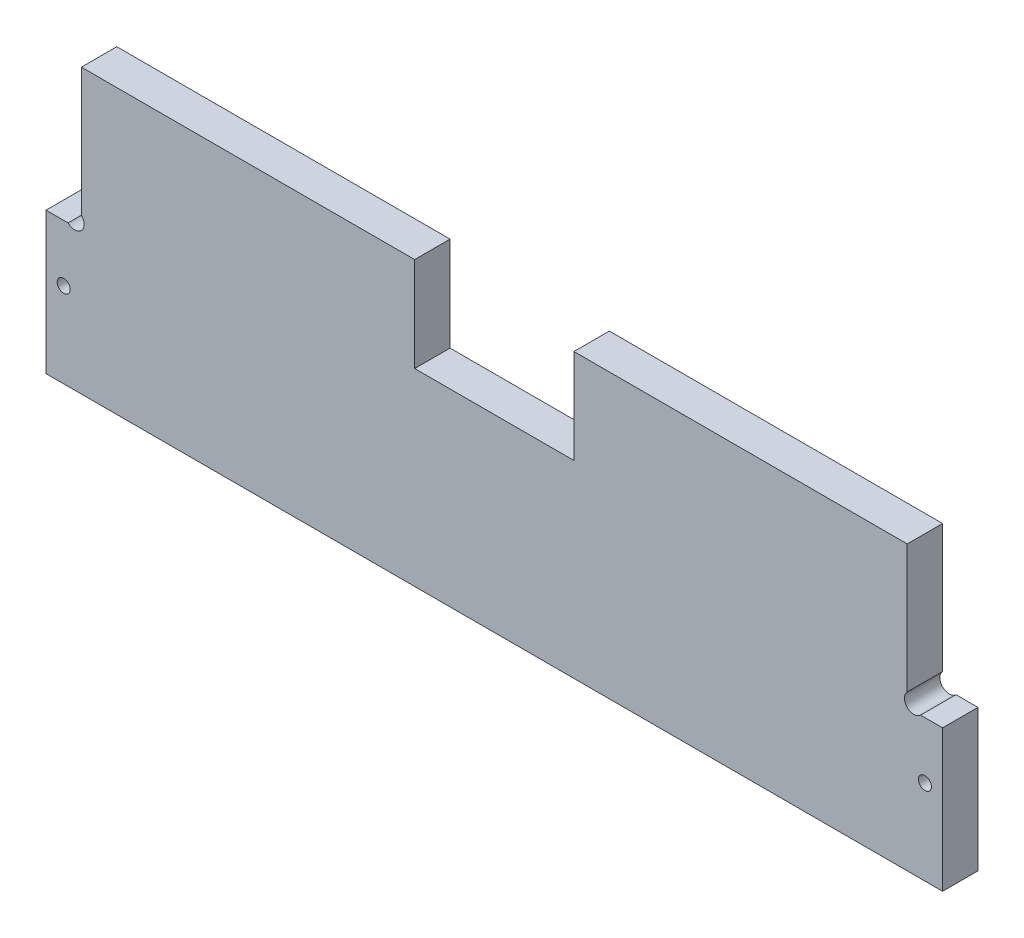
from build123d import *

# Parameters (mm, degrees)
ESQUISSE1_R        = 1.1
BOSS_EXTRU_1_DEPTH = 6


with BuildPart() as part:
    # Esquisse1 → Boss.-Extru.1 (new body)
    with BuildSketch(Plane.XY):
        with BuildLine():
            Line((13.5, 48), (70, 48))
            Line((70, 48), (70, 26.2627417))
            ThreePointArc((70, 26.2627417), (70, 24), (72.2627417, 24))
            Line((72.2627417, 24), (76, 24))
            Line((76, 24), (76, 0))
            Line((76, 0), (-76, 0))
            Line((-76, 0), (-76, 24))
            Line((-76, 24), (-72.2627417, 24))
            ThreePointArc((-72.2627417, 24), (-70, 24), (-70, 26.2627417))
            Line((-70, 26.2627417), (-70, 48))
            Line((-70, 48), (-13.5, 48))
            Line((-13.5, 48), (-13.5, 32))
            Line((-13.5, 32), (13.5, 32))
            Line((13.5, 32), (13.5, 48))
        make_face()
        with Locations((73, 14.392063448)):
            Circle(ESQUISSE1_R, mode=Mode.SUBTRACT)
        with Locations(Location((-73, 14.392063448, 0), (0, 0, 180))):
            Circle(ESQUISSE1_R, mode=Mode.SUBTRACT)
    extrude(amount=BOSS_EXTRU_1_DEPTH)


solid = part.part
